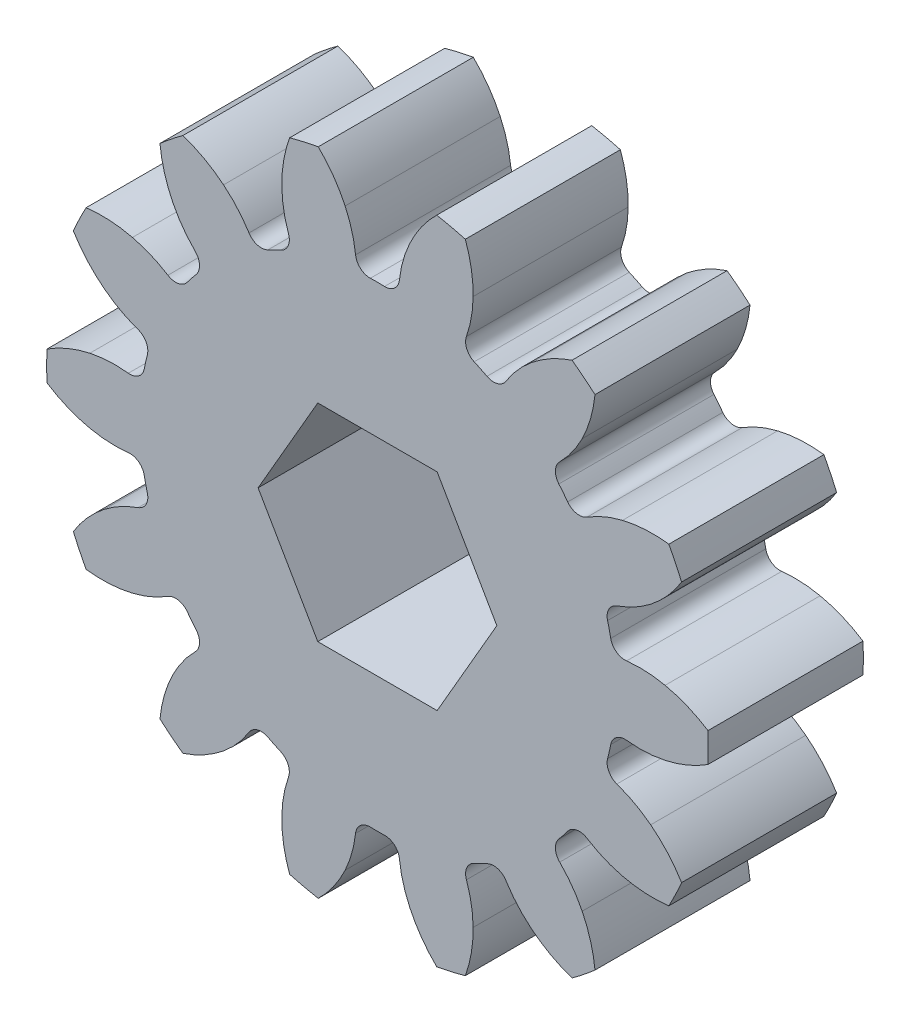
from build123d import *

# Parameters (mm, degrees)
SKETCH1_R            = 20.32
ROUND_STOCK_DEPTH    = 4.7625
SINGLE_TOOTH_DEPTH   = 31.2742535
TOOTH_PATTERN_COUNT  = 14
ROUNDBORE_DEPTH      = 29.900711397
ROUNDBORE_DEPTH_BACK = 29.900711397
SKETCH5_R            = 2.5781
CUT_EXTRUDE1_DEPTH   = 31.054872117


with BuildPart() as part:
    # Sketch1 → Round Stock (new, symmetric)
    with BuildSketch(Plane.XY):
        with Locations(Location((0, 0, 0), (0, 0, 180))):
            Circle(SKETCH1_R)
    extrude(amount=ROUND_STOCK_DEPTH, both=True)

    # Sketch2 → Single Tooth (cut, through all)
    with BuildSketch(Plane.XY.offset(4.7625)):
        with BuildLine():
            ThreePointArc((-18.680915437, -7.995361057), (-19.810535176, -4.521625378), (-20.299980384, -0.90177404))
            ThreePointArc((-20.299980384, -0.90177404), (-19.033050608, -1.566940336), (-17.667702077, -1.99517))
            ThreePointArc((-17.667702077, -1.99517), (-16.49068842, -2.15119119), (-15.304023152, -2.112084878))
            ThreePointArc((-15.304023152, -2.112084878), (-14.677649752, -2.277093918), (-14.329509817, -2.823326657))
            ThreePointArc((-14.329509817, -2.823326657), (-14.238822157, -3.24991824), (-14.135437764, -3.673611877))
            ThreePointArc((-14.135437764, -3.673611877), (-14.212099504, -4.316802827), (-14.704847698, -4.737244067))
            ThreePointArc((-14.704847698, -4.737244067), (-15.790963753, -5.216885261), (-16.783721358, -5.868142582))
            ThreePointArc((-16.783721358, -5.868142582), (-17.828055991, -6.846366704), (-18.680915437, -7.995361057))
        make_face()
    single_tooth = extrude(amount=-SINGLE_TOOTH_DEPTH, mode=Mode.SUBTRACT)

    # Tooth Pattern: Single Tooth ×14 about axis
    tooth_pattern_axis = Axis((0, 0, 0), (0, 0, 1))
    for i in range(1, TOOTH_PATTERN_COUNT):
        add(single_tooth.rotate(tooth_pattern_axis, i * 360 / TOOTH_PATTERN_COUNT), mode=Mode.SUBTRACT)

    # Sketch5 → RoundBore (cut, two sides: drawn at the far end of the back side and taken through both)
    with BuildSketch(Plane.XY.offset(-ROUNDBORE_DEPTH_BACK)):
        Circle(SKETCH5_R)
    extrude(amount=ROUNDBORE_DEPTH + ROUNDBORE_DEPTH_BACK, mode=Mode.SUBTRACT)

    # Sketch8 → Cut-Extrude1 (cut, through all)
    with BuildSketch(Plane(origin=(0, 0, -4.7625), x_dir=(-1, 0, 0), z_dir=(0, 0, -1))):
        Polygon((3.666174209, -6.35), (7.332348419, 0), (3.666174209, 6.35), (-3.666174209, 6.35), (-7.332348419, 0), (-3.666174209, -6.35), align=None)
    extrude(amount=-CUT_EXTRUDE1_DEPTH, mode=Mode.SUBTRACT)


solid = part.part
